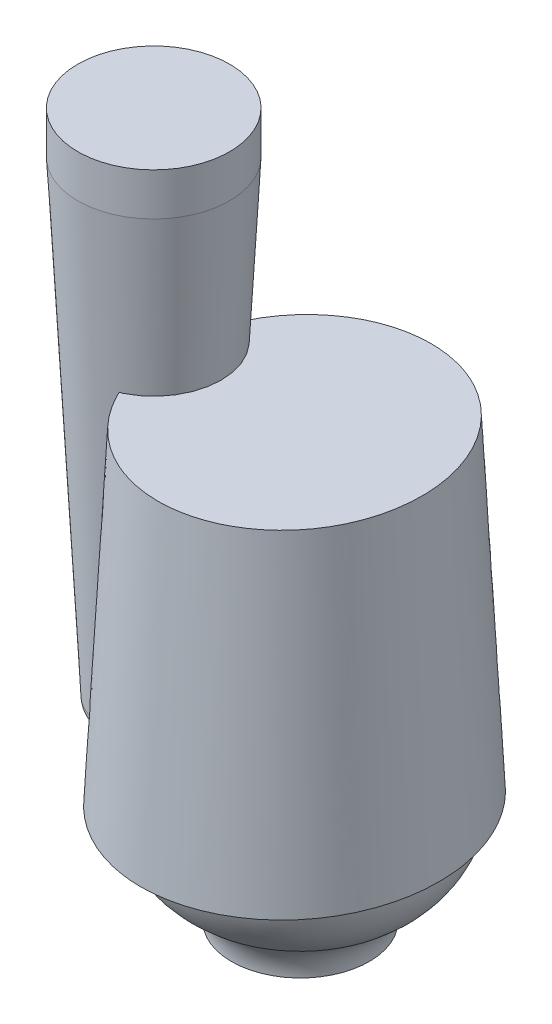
ISO-10303-21;
HEADER;
FILE_DESCRIPTION(('STEP AP214'),'2;1');
FILE_NAME('part.step','',(''),(''),'','','');
FILE_SCHEMA(('AUTOMOTIVE_DESIGN { 1 0 10303 214 1 1 1 1 }'));
ENDSEC;
DATA;
#1=APPLICATION_CONTEXT('core data for automotive mechanical design processes');
#2=APPLICATION_PROTOCOL_DEFINITION('international standard','automotive_design',2000,#1);
#3=PRODUCT_CONTEXT('',#1,'mechanical');
#4=PRODUCT('Part','Part','',(#3));
#5=PRODUCT_RELATED_PRODUCT_CATEGORY('part','',(#4));
#6=PRODUCT_DEFINITION_FORMATION('','',#4);
#7=PRODUCT_DEFINITION_CONTEXT('part definition',#1,'design');
#8=PRODUCT_DEFINITION('design','',#6,#7);
#9=PRODUCT_DEFINITION_SHAPE('','',#8);
#10=(LENGTH_UNIT() NAMED_UNIT(*) SI_UNIT(.MILLI.,.METRE.));
#11=(NAMED_UNIT(*) PLANE_ANGLE_UNIT() SI_UNIT($,.RADIAN.));
#12=(NAMED_UNIT(*) SI_UNIT($,.STERADIAN.) SOLID_ANGLE_UNIT());
#13=UNCERTAINTY_MEASURE_WITH_UNIT(LENGTH_MEASURE(1.E-05),#10,'distance_accuracy_value','');
#14=(GEOMETRIC_REPRESENTATION_CONTEXT(3) GLOBAL_UNCERTAINTY_ASSIGNED_CONTEXT((#13)) GLOBAL_UNIT_ASSIGNED_CONTEXT((#10,
#11,#12)) REPRESENTATION_CONTEXT('',''));
#15=CARTESIAN_POINT('',(0.,0.,0.));
#16=DIRECTION('',(0.,0.,1.));
#17=DIRECTION('',(1.,0.,0.));
#18=AXIS2_PLACEMENT_3D('',#15,#16,#17);
#19=CARTESIAN_POINT('',(-9.73244357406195,37.6685351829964,0.));
#20=DIRECTION('',(0.,1.,0.));
#21=DIRECTION('',(-1.,0.,0.));
#22=AXIS2_PLACEMENT_3D('',#19,#20,#21);
#23=CYLINDRICAL_SURFACE('',#22,5.03681306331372);
#24=CARTESIAN_POINT('',(-9.73244357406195,34.9999999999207,0.));
#25=DIRECTION('',(0.,1.,0.));
#26=DIRECTION('',(-1.,0.,0.));
#27=AXIS2_PLACEMENT_3D('',#24,#25,#26);
#28=CIRCLE('',#27,5.03681306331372);
#29=CARTESIAN_POINT('',(-14.7692566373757,34.9999999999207,0.));
#30=VERTEX_POINT('',#29);
#31=EDGE_CURVE('E11',#30,#30,#28,.T.);
#32=ORIENTED_EDGE('',*,*,#31,.F.);
#33=EDGE_LOOP('',(#32));
#34=FACE_BOUND('',#33,.T.);
#35=CARTESIAN_POINT('',(-9.73244357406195,32.1779999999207,0.));
#36=DIRECTION('',(0.,1.,0.));
#37=DIRECTION('',(-1.,0.,0.));
#38=AXIS2_PLACEMENT_3D('',#35,#36,#37);
#39=CIRCLE('',#38,5.03681306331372);
#40=CARTESIAN_POINT('',(-14.7692566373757,32.1779999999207,0.));
#41=VERTEX_POINT('',#40);
#42=EDGE_CURVE('E53',#41,#41,#39,.T.);
#43=ORIENTED_EDGE('',*,*,#42,.T.);
#44=EDGE_LOOP('',(#43));
#45=FACE_BOUND('',#44,.T.);
#46=ADVANCED_FACE('F39',(#34,#45),#23,.T.);
#47=CARTESIAN_POINT('',(-4.69563051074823,34.9999999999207,0.));
#48=DIRECTION('',(0.,-1.,0.));
#49=DIRECTION('',(1.,0.,0.));
#50=AXIS2_PLACEMENT_3D('',#47,#48,#49);
#51=PLANE('',#50);
#52=ORIENTED_EDGE('',*,*,#31,.T.);
#53=EDGE_LOOP('',(#52));
#54=FACE_BOUND('',#53,.T.);
#55=ADVANCED_FACE('F73',(#54),#51,.F.);
#56=CARTESIAN_POINT('',(-9.73244357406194,0.,0.));
#57=DIRECTION('',(0.,1.,0.));
#58=DIRECTION('',(-1.,0.,0.));
#59=AXIS2_PLACEMENT_3D('',#56,#57,#58);
#60=PLANE('',#59);
#61=CARTESIAN_POINT('',(-9.73244357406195,0.,0.));
#62=DIRECTION('',(0.,1.,0.));
#63=DIRECTION('',(-1.,0.,0.));
#64=AXIS2_PLACEMENT_3D('',#61,#62,#63);
#65=CIRCLE('',#64,2.11678160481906);
#66=CARTESIAN_POINT('',(-11.849225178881,0.,0.));
#67=VERTEX_POINT('',#66);
#68=EDGE_CURVE('E45',#67,#67,#65,.T.);
#69=ORIENTED_EDGE('',*,*,#68,.F.);
#70=EDGE_LOOP('',(#69));
#71=FACE_BOUND('',#70,.T.);
#72=ADVANCED_FACE('F68',(#71),#60,.F.);
#73=CARTESIAN_POINT('',(-9.73244357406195,1.3,0.));
#74=DIRECTION('',(0.,1.,0.));
#75=DIRECTION('',(-1.,0.,0.));
#76=AXIS2_PLACEMENT_3D('',#73,#74,#75);
#77=TOROIDAL_SURFACE('',#76,2.11678160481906,1.3);
#78=CARTESIAN_POINT('',(-9.73244357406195,1.23196325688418,0.));
#79=DIRECTION('',(0.,1.,0.));
#80=DIRECTION('',(-1.,0.,0.));
#81=AXIS2_PLACEMENT_3D('',#78,#79,#80);
#82=CIRCLE('',#81,3.415);
#83=CARTESIAN_POINT('',(-13.147443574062,1.23196325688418,0.));
#84=VERTEX_POINT('',#83);
#85=EDGE_CURVE('E49',#84,#84,#82,.T.);
#86=ORIENTED_EDGE('',*,*,#85,.F.);
#87=EDGE_LOOP('',(#86));
#88=FACE_BOUND('',#87,.T.);
#89=ORIENTED_EDGE('',*,*,#68,.T.);
#90=EDGE_LOOP('',(#89));
#91=FACE_BOUND('',#90,.T.);
#92=ADVANCED_FACE('F63',(#88,#91),#77,.T.);
#93=CARTESIAN_POINT('',(-9.73244357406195,1.23196325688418,0.));
#94=DIRECTION('',(0.,1.,0.));
#95=DIRECTION('',(-1.,0.,0.));
#96=AXIS2_PLACEMENT_3D('',#93,#94,#95);
#97=CONICAL_SURFACE('',#96,3.415,0.0523598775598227);
#98=ORIENTED_EDGE('',*,*,#42,.F.);
#99=EDGE_LOOP('',(#98));
#100=FACE_BOUND('',#99,.T.);
#101=ORIENTED_EDGE('',*,*,#85,.T.);
#102=EDGE_LOOP('',(#101));
#103=FACE_BOUND('',#102,.T.);
#104=ADVANCED_FACE('F60',(#100,#103),#97,.T.);
#105=CLOSED_SHELL('',(#46,#55,#72,#92,#104));
#106=MANIFOLD_SOLID_BREP('B2',#105);
#107=CARTESIAN_POINT('',(-4.575,-6.9,0.));
#108=DIRECTION('',(0.,1.,0.));
#109=DIRECTION('',(0.,0.,1.));
#110=AXIS2_PLACEMENT_3D('',#107,#108,#109);
#111=PLANE('',#110);
#112=CARTESIAN_POINT('',(0.,-6.9,0.));
#113=DIRECTION('',(0.,1.,0.));
#114=DIRECTION('',(0.,0.,1.));
#115=AXIS2_PLACEMENT_3D('',#112,#113,#114);
#116=CIRCLE('',#115,4.575);
#117=CARTESIAN_POINT('',(0.,-6.9,4.575));
#118=VERTEX_POINT('',#117);
#119=EDGE_CURVE('E38',#118,#118,#116,.T.);
#120=ORIENTED_EDGE('',*,*,#119,.F.);
#121=EDGE_LOOP('',(#120));
#122=FACE_BOUND('',#121,.T.);
#123=ADVANCED_FACE('F110',(#122),#111,.F.);
#124=CARTESIAN_POINT('',(0.,-6.9,0.));
#125=DIRECTION('',(0.,1.,0.));
#126=DIRECTION('',(0.,0.,1.));
#127=AXIS2_PLACEMENT_3D('',#124,#125,#126);
#128=TOROIDAL_SURFACE('',#127,7.575,3.);
#129=CARTESIAN_POINT('',(0.,-4.3359788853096,0.));
#130=DIRECTION('',(0.,1.,0.));
#131=DIRECTION('',(0.,0.,1.));
#132=AXIS2_PLACEMENT_3D('',#129,#130,#131);
#133=CIRCLE('',#132,6.01750337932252);
#134=CARTESIAN_POINT('',(0.,-4.3359788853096,6.01750337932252));
#135=VERTEX_POINT('',#134);
#136=EDGE_CURVE('E119',#135,#135,#133,.T.);
#137=ORIENTED_EDGE('',*,*,#136,.F.);
#138=EDGE_LOOP('',(#137));
#139=FACE_BOUND('',#138,.T.);
#140=ORIENTED_EDGE('',*,*,#119,.T.);
#141=EDGE_LOOP('',(#140));
#142=FACE_BOUND('',#141,.T.);
#143=ADVANCED_FACE('F158',(#139,#142),#128,.F.);
#144=CARTESIAN_POINT('',(0.,0.792063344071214,0.));
#145=DIRECTION('',(0.,1.,0.));
#146=DIRECTION('',(0.,0.,1.));
#147=AXIS2_PLACEMENT_3D('',#144,#145,#146);
#148=DEGENERATE_TOROIDAL_SURFACE('',#147,2.90251013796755,6.,.T.);
#149=CARTESIAN_POINT('',(0.,0.,0.));
#150=DIRECTION('',(0.,1.,0.));
#151=DIRECTION('',(0.,0.,1.));
#152=AXIS2_PLACEMENT_3D('',#149,#150,#151);
#153=CIRCLE('',#152,8.85);
#154=CARTESIAN_POINT('',(0.,0.,8.85));
#155=VERTEX_POINT('',#154);
#156=EDGE_CURVE('E124',#155,#155,#153,.T.);
#157=ORIENTED_EDGE('',*,*,#156,.F.);
#158=EDGE_LOOP('',(#157));
#159=FACE_BOUND('',#158,.T.);
#160=ORIENTED_EDGE('',*,*,#136,.T.);
#161=EDGE_LOOP('',(#160));
#162=FACE_BOUND('',#161,.T.);
#163=ADVANCED_FACE('F152',(#159,#162),#148,.T.);
#164=CARTESIAN_POINT('',(-0.379855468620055,0.,-9.05999349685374));
#165=DIRECTION('',(0.,-1.,0.));
#166=DIRECTION('',(0.,0.,-1.));
#167=AXIS2_PLACEMENT_3D('',#164,#165,#166);
#168=PLANE('',#167);
#169=CARTESIAN_POINT('',(-0.378402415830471,0.,-10.192000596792));
#170=CARTESIAN_POINT('',(-0.507007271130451,0.,-10.1921862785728));
#171=CARTESIAN_POINT('',(-0.635622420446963,0.,-10.1896287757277));
#172=CARTESIAN_POINT('',(-0.892632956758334,0.,-10.1790601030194));
#173=CARTESIAN_POINT('',(-1.02102832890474,0.,-10.1710485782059));
#174=CARTESIAN_POINT('',(-1.27739759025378,0.,-10.1495308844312));
#175=CARTESIAN_POINT('',(-1.40537135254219,0.,-10.1360231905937));
#176=CARTESIAN_POINT('',(-1.66061259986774,0.,-10.1035497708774));
#177=CARTESIAN_POINT('',(-1.7878800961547,0.,-10.0845841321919));
#178=CARTESIAN_POINT('',(-2.16858171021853,0.,-10.0195774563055));
#179=CARTESIAN_POINT('',(-2.42068390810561,0.,-9.96544622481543));
#180=CARTESIAN_POINT('',(-2.91937723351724,0.,-9.83615786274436));
#181=CARTESIAN_POINT('',(-3.16596878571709,0.,-9.76100235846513));
#182=CARTESIAN_POINT('',(-3.65160816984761,0.,-9.59041030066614));
#183=CARTESIAN_POINT('',(-3.89066714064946,0.,-9.49500547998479));
#184=CARTESIAN_POINT('',(-4.36004480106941,0.,-9.28469929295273));
#185=CARTESIAN_POINT('',(-4.59036337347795,0.,-9.169797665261));
#186=CARTESIAN_POINT('',(-5.04071983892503,0.,-8.921487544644));
#187=CARTESIAN_POINT('',(-5.26076014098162,0.,-8.78808341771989));
#188=CARTESIAN_POINT('',(-5.68933559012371,0.,-8.50393281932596));
#189=CARTESIAN_POINT('',(-5.89787051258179,0.,-8.35318600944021));
#190=CARTESIAN_POINT('',(-6.30754408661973,0.,-8.03132078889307));
#191=CARTESIAN_POINT('',(-6.50834368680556,0.,-7.85977068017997));
#192=CARTESIAN_POINT('',(-6.89528996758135,0.,-7.50088751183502));
#193=CARTESIAN_POINT('',(-7.08143659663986,0.,-7.31355439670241));
#194=CARTESIAN_POINT('',(-7.43825131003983,0.,-6.92462790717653));
#195=CARTESIAN_POINT('',(-7.60891628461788,0.,-6.72303168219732));
#196=CARTESIAN_POINT('',(-7.93382976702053,0.,-6.30701525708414));
#197=CARTESIAN_POINT('',(-8.08807754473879,0.,-6.09259448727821));
#198=CARTESIAN_POINT('',(-8.38703932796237,0.,-5.64110479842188));
#199=CARTESIAN_POINT('',(-8.53085068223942,0.,-5.40343814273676));
#200=CARTESIAN_POINT('',(-8.79898835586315,0.,-4.91736095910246));
#201=CARTESIAN_POINT('',(-8.923314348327,0.,-4.66895025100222));
#202=CARTESIAN_POINT('',(-9.15181197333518,0.,-4.16296877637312));
#203=CARTESIAN_POINT('',(-9.25597945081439,0.,-3.90539613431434));
#204=CARTESIAN_POINT('',(-9.44375483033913,0.,-3.38286329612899));
#205=CARTESIAN_POINT('',(-9.52736214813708,0.,-3.11790289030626));
#206=CARTESIAN_POINT('',(-9.67786051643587,0.,-2.56671926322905));
#207=CARTESIAN_POINT('',(-9.74350060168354,0.,-2.28015418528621));
#208=CARTESIAN_POINT('',(-9.85137152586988,0.,-1.70264482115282));
#209=CARTESIAN_POINT('',(-9.8936011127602,0.,-1.41170030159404));
#210=CARTESIAN_POINT('',(-9.95431388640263,0.,-0.827279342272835));
#211=CARTESIAN_POINT('',(-9.97279146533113,0.,-0.53380232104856));
#212=CARTESIAN_POINT('',(-9.98585546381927,0.,0.0537119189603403));
#213=CARTESIAN_POINT('',(-9.98044226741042,0.,0.34774912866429));
#214=CARTESIAN_POINT('',(-9.95408315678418,0.,0.792937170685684));
#215=CARTESIAN_POINT('',(-9.9418809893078,0.,0.944651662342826));
#216=CARTESIAN_POINT('',(-9.91106989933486,0.,1.24742894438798));
#217=CARTESIAN_POINT('',(-9.8924608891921,0.,1.39849172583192));
#218=CARTESIAN_POINT('',(-9.82716426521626,0.,1.85032151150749));
#219=CARTESIAN_POINT('',(-9.77100415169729,0.,2.14977843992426));
#220=CARTESIAN_POINT('',(-9.63352585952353,0.,2.74284163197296));
#221=CARTESIAN_POINT('',(-9.5522058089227,0.,3.03644745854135));
#222=CARTESIAN_POINT('',(-9.36465533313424,0.,3.61564014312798));
#223=CARTESIAN_POINT('',(-9.25842654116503,0.,3.90122752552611));
#224=CARTESIAN_POINT('',(-9.08123378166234,0.,4.32080114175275));
#225=CARTESIAN_POINT('',(-9.01944007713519,0.,4.45872661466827));
#226=CARTESIAN_POINT('',(-8.88988183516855,0.,4.73175728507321));
#227=CARTESIAN_POINT('',(-8.82211729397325,0.,4.86686248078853));
#228=CARTESIAN_POINT('',(-8.68074838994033,0.,5.13398967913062));
#229=CARTESIAN_POINT('',(-8.60714364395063,0.,5.26601147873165));
#230=CARTESIAN_POINT('',(-8.45423371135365,0.,5.526711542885));
#231=CARTESIAN_POINT('',(-8.37492861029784,0.,5.65538985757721));
#232=CARTESIAN_POINT('',(-8.21067635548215,0.,5.90906178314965));
#233=CARTESIAN_POINT('',(-8.12573020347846,0.,6.03405604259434));
#234=CARTESIAN_POINT('',(-7.95040477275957,0.,6.28017398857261));
#235=CARTESIAN_POINT('',(-7.86002547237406,0.,6.40129765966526));
#236=CARTESIAN_POINT('',(-7.67394975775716,0.,6.63938059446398));
#237=CARTESIAN_POINT('',(-7.57825371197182,0.,6.7563401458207));
#238=CARTESIAN_POINT('',(-7.3815668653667,0.,6.98571699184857));
#239=CARTESIAN_POINT('',(-7.28057613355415,0.,7.09813434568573));
#240=CARTESIAN_POINT('',(-7.07844500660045,0.,7.31308230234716));
#241=CARTESIAN_POINT('',(-6.9775347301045,0.,7.41582925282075));
#242=CARTESIAN_POINT('',(-6.77126477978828,0.,7.61676005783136));
#243=CARTESIAN_POINT('',(-6.66590473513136,0.,7.71494353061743));
#244=CARTESIAN_POINT('',(-6.34341689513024,0.,8.00227489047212));
#245=CARTESIAN_POINT('',(-6.11982475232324,0.,8.18426405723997));
#246=CARTESIAN_POINT('',(-5.65733234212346,0.,8.52737210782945));
#247=CARTESIAN_POINT('',(-5.41843701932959,0.,8.68849768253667));
#248=CARTESIAN_POINT('',(-4.92689044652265,0.,8.98830735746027));
#249=CARTESIAN_POINT('',(-4.67424001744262,0.,9.12699279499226));
#250=CARTESIAN_POINT('',(-4.29452895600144,0.,9.31309242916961));
#251=CARTESIAN_POINT('',(-4.17198484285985,0.,9.36988066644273));
#252=CARTESIAN_POINT('',(-3.92455615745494,0.,9.47808606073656));
#253=CARTESIAN_POINT('',(-3.79967174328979,0.,9.52950357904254));
#254=CARTESIAN_POINT('',(-3.4218152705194,0.,9.67542841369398));
#255=CARTESIAN_POINT('',(-3.1655790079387,0.,9.76163795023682));
#256=CARTESIAN_POINT('',(-2.64664790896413,0.,9.91102022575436));
#257=CARTESIAN_POINT('',(-2.38395623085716,0.,9.9742039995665));
#258=CARTESIAN_POINT('',(-1.85386887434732,0.,10.0770559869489));
#259=CARTESIAN_POINT('',(-1.5864711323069,0.,10.1167136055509));
#260=CARTESIAN_POINT('',(-1.06104941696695,0.,10.1707898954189));
#261=CARTESIAN_POINT('',(-0.803131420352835,0.,10.1862434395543));
#262=CARTESIAN_POINT('',(-0.286921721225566,0.,10.1951170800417));
#263=CARTESIAN_POINT('',(-0.028630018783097,0.,10.1885371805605));
#264=CARTESIAN_POINT('',(0.486450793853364,0.,10.1533138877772));
#265=CARTESIAN_POINT('',(0.743240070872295,0.,10.124672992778));
#266=CARTESIAN_POINT('',(1.12581467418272,0.,10.0653533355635));
#267=CARTESIAN_POINT('',(1.25291790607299,0.,10.0428504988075));
#268=CARTESIAN_POINT('',(1.50606665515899,0.,9.99249739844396));
#269=CARTESIAN_POINT('',(1.63211212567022,0.,9.96464690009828));
#270=CARTESIAN_POINT('',(2.0052628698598,0.,9.87384746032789));
#271=CARTESIAN_POINT('',(2.25053098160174,0.,9.80316038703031));
#272=CARTESIAN_POINT('',(2.73430595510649,0.,9.6416649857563));
#273=CARTESIAN_POINT('',(2.97281289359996,0.,9.55085688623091));
#274=CARTESIAN_POINT('',(3.44156730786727,0.,9.34994519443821));
#275=CARTESIAN_POINT('',(3.67181459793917,0.,9.23984116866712));
#276=CARTESIAN_POINT('',(4.12253981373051,0.,9.00119241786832));
#277=CARTESIAN_POINT('',(4.3430176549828,0.,8.87264753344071));
#278=CARTESIAN_POINT('',(4.77744822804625,0.,8.59521769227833));
#279=CARTESIAN_POINT('',(4.99116070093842,0.,8.44595665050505));
#280=CARTESIAN_POINT('',(5.40578090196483,0.,8.13060568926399));
#281=CARTESIAN_POINT('',(5.60668829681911,0.,7.96451533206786));
#282=CARTESIAN_POINT('',(5.99457251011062,0.,7.61674502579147));
#283=CARTESIAN_POINT('',(6.18154717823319,0.,7.43506267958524));
#284=CARTESIAN_POINT('',(6.54053453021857,0.,7.05748384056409));
#285=CARTESIAN_POINT('',(6.71254714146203,0.,6.86158727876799));
#286=CARTESIAN_POINT('',(7.048653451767,0.,6.44712970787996));
#287=CARTESIAN_POINT('',(7.21196060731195,0.,6.22793059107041));
#288=CARTESIAN_POINT('',(7.52048041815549,0.,5.77716007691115));
#289=CARTESIAN_POINT('',(7.66569196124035,0.,5.54558792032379));
#290=CARTESIAN_POINT('',(7.93745857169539,0.,5.07164399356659));
#291=CARTESIAN_POINT('',(8.06400969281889,0.,4.82926995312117));
#292=CARTESIAN_POINT('',(8.23916343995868,0.,4.45884607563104));
#293=CARTESIAN_POINT('',(8.29510671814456,0.,4.33421662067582));
#294=CARTESIAN_POINT('',(8.40208986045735,0.,4.08286204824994));
#295=CARTESIAN_POINT('',(8.45312968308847,0.,3.9561369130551));
#296=CARTESIAN_POINT('',(8.55311931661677,0.,3.69323268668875));
#297=CARTESIAN_POINT('',(8.60176608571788,0.,3.5569383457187));
#298=CARTESIAN_POINT('',(8.69340458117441,0.,3.28246033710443));
#299=CARTESIAN_POINT('',(8.73639622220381,0.,3.14427664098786));
#300=CARTESIAN_POINT('',(8.81678315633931,0.,2.86628136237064));
#301=CARTESIAN_POINT('',(8.85417802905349,0.,2.72646965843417));
#302=CARTESIAN_POINT('',(8.92333767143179,0.,2.44546065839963));
#303=CARTESIAN_POINT('',(8.95510247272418,0.,2.30426337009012));
#304=CARTESIAN_POINT('',(9.01289841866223,0.,2.02066634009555));
#305=CARTESIAN_POINT('',(9.03892823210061,0.,1.87826632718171));
#306=CARTESIAN_POINT('',(9.08530303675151,0.,1.59254486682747));
#307=CARTESIAN_POINT('',(9.10564802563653,0.,1.44922341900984));
#308=CARTESIAN_POINT('',(9.14056663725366,0.,1.16188045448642));
#309=CARTESIAN_POINT('',(9.15514045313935,0.,1.01785896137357));
#310=CARTESIAN_POINT('',(9.17847727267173,0.,0.729355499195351));
#311=CARTESIAN_POINT('',(9.18724025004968,0.,0.584873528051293));
#312=CARTESIAN_POINT('',(9.20533963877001,0.,0.138415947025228));
#313=CARTESIAN_POINT('',(9.20494252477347,0.,-0.164016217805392));
#314=CARTESIAN_POINT('',(9.17892359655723,0.,-0.767765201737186));
#315=CARTESIAN_POINT('',(9.15329968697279,0.,-1.06908192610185));
#316=CARTESIAN_POINT('',(9.07698497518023,0.,-1.6686083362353));
#317=CARTESIAN_POINT('',(9.02629140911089,0.,-1.96681767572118));
#318=CARTESIAN_POINT('',(8.93173838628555,0.,-2.41009843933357));
#319=CARTESIAN_POINT('',(8.89713138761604,0.,-2.55719931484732));
#320=CARTESIAN_POINT('',(8.82169855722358,0.,-2.84979775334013));
#321=CARTESIAN_POINT('',(8.780872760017,0.,-2.99529532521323));
#322=CARTESIAN_POINT('',(8.64850185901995,0.,-3.43105052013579));
#323=CARTESIAN_POINT('',(8.54750340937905,0.,-3.71849898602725));
#324=CARTESIAN_POINT('',(8.32100322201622,0.,-4.28355680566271));
#325=CARTESIAN_POINT('',(8.1955001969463,0.,-4.56116564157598));
#326=CARTESIAN_POINT('',(7.92067930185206,0.,-5.10429723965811));
#327=CARTESIAN_POINT('',(7.77136509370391,0.,-5.36982185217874));
#328=CARTESIAN_POINT('',(7.44988044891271,0.,-5.8866502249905));
#329=CARTESIAN_POINT('',(7.27771161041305,0.,-6.13795497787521));
#330=CARTESIAN_POINT('',(6.91800045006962,0.,-6.6148743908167));
#331=CARTESIAN_POINT('',(6.73126255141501,0.,-6.84109552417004));
#332=CARTESIAN_POINT('',(6.33851319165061,0.,-7.27613183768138));
#333=CARTESIAN_POINT('',(6.13250269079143,0.,-7.48494788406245));
#334=CARTESIAN_POINT('',(5.7025459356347,0.,-7.88324026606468));
#335=CARTESIAN_POINT('',(5.47859947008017,0.,-8.07271637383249));
#336=CARTESIAN_POINT('',(5.01432512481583,0.,-8.43040234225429));
#337=CARTESIAN_POINT('',(4.77399863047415,0.,-8.59861399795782));
#338=CARTESIAN_POINT('',(4.29383701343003,0.,-8.90250884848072));
#339=CARTESIAN_POINT('',(4.05485754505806,0.,-9.03954674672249));
#340=CARTESIAN_POINT('',(3.5657108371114,0.,-9.29210308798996));
#341=CARTESIAN_POINT('',(3.31554301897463,0.,-9.40762041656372));
#342=CARTESIAN_POINT('',(2.93359809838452,0.,-9.56377254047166));
#343=CARTESIAN_POINT('',(2.80524970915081,0.,-9.61294393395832));
#344=CARTESIAN_POINT('',(2.54646304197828,0.,-9.70546515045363));
#345=CARTESIAN_POINT('',(2.41602479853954,0.,-9.74881506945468));
#346=CARTESIAN_POINT('',(2.15337134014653,0.,-9.8295561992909));
#347=CARTESIAN_POINT('',(2.02115683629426,0.,-9.86694972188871));
#348=CARTESIAN_POINT('',(1.75519625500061,0.,-9.93578472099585));
#349=CARTESIAN_POINT('',(1.62145009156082,0.,-9.96722586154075));
#350=CARTESIAN_POINT('',(1.18066071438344,0.,-10.0602664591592));
#351=CARTESIAN_POINT('',(0.87075817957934,0.,-10.1090056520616));
#352=CARTESIAN_POINT('',(0.4036150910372,0.,-10.1582326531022));
#353=CARTESIAN_POINT('',(0.247503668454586,0.,-10.1706614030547));
#354=CARTESIAN_POINT('',(0.0129870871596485,0.,-10.1832515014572));
#355=CARTESIAN_POINT('',(-0.0652535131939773,0.,-10.1864393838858));
#356=CARTESIAN_POINT('',(-0.221795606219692,0.,-10.1907574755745));
#357=CARTESIAN_POINT('',(-0.300097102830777,0.,-10.191887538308));
#358=CARTESIAN_POINT('',(-0.378402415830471,0.,-10.192000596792));
#359=B_SPLINE_CURVE_WITH_KNOTS('',3,(#169,#170,#171,#172,#173,#174,#175,#176,#177,#178,#179,
#180,#181,#182,#183,#184,#185,#186,#187,#188,#189,#190,#191,#192,#193,#194,#195,#196,#197,#198,
#199,#200,#201,#202,#203,#204,#205,#206,#207,#208,#209,#210,#211,#212,#213,#214,#215,#216,#217,
#218,#219,#220,#221,#222,#223,#224,#225,#226,#227,#228,#229,#230,#231,#232,#233,#234,#235,#236,
#237,#238,#239,#240,#241,#242,#243,#244,#245,#246,#247,#248,#249,#250,#251,#252,#253,#254,#255,
#256,#257,#258,#259,#260,#261,#262,#263,#264,#265,#266,#267,#268,#269,#270,#271,#272,#273,#274,
#275,#276,#277,#278,#279,#280,#281,#282,#283,#284,#285,#286,#287,#288,#289,#290,#291,#292,#293,
#294,#295,#296,#297,#298,#299,#300,#301,#302,#303,#304,#305,#306,#307,#308,#309,#310,#311,#312,
#313,#314,#315,#316,#317,#318,#319,#320,#321,#322,#323,#324,#325,#326,#327,#328,#329,#330,#331,
#332,#333,#334,#335,#336,#337,#338,#339,#340,#341,#342,#343,#344,#345,#346,#347,#348,#349,#350,
#351,#352,#353,#354,#355,#356,#357,#358),.UNSPECIFIED.,.T.,.F.,(4,2,2,2,2,2,2,2,2,2,2,2,2,2,2,2,
2,2,2,2,2,2,2,2,2,2,2,2,2,2,2,2,2,2,2,2,2,2,2,2,2,2,2,2,2,2,2,2,2,2,2,2,2,2,2,2,2,2,2,2,2,2,2,2,
2,2,2,2,2,2,2,2,2,2,2,2,2,2,2,2,2,2,2,2,2,2,2,2,2,2,2,2,2,2,4),(0.,0.385797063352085,
0.771619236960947,1.15754852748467,1.54347165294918,2.31601127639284,3.08849115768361,
3.85976930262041,4.63105778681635,5.40216458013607,6.1732864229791,6.96470085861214,
7.75611807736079,8.54769391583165,9.33930494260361,10.1717635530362,11.0042361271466,
11.8368801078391,12.6695477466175,13.5505153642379,14.4315300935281,15.3127527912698,
16.1939613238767,16.6504544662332,17.106953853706,18.0198073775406,18.9327288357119,
19.8455904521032,20.2988796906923,20.7521692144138,21.2054885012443,21.6588009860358,
22.1120331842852,22.5652671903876,23.0184698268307,23.4716665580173,23.9035632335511,
24.3354959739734,25.1991140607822,26.0624544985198,26.9257434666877,27.3308248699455,
27.7358790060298,28.5457842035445,29.3553007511,30.1651815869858,30.9393853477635,
31.7135889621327,32.487704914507,32.8748444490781,33.2620009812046,34.0267855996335,
34.7915615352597,35.5563546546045,36.3211543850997,37.1023041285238,37.8834741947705,
38.6647645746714,39.4460587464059,40.26517767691,41.084346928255,41.9036891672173,
42.3134308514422,42.7231760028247,43.1572000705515,43.5912306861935,44.0252938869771,
44.4593546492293,44.8935160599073,45.3276776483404,45.7618247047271,46.1959737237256,
47.1021081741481,48.0083178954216,48.9146275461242,49.3678625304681,49.8210949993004,
50.7338926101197,51.6467381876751,52.5594435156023,53.4720850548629,54.3509619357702,
55.2297950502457,56.1086385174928,56.9874077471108,57.8128356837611,58.6383063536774,
59.0505279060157,59.4627426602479,59.8747970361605,60.286874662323,61.2259999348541,
61.6956552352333,61.9305437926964,62.1654490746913),.UNSPECIFIED.);
#360=CARTESIAN_POINT('',(-0.378402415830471,0.,-10.192000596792));
#361=VERTEX_POINT('',#360);
#362=EDGE_CURVE('E134',#361,#361,#359,.T.);
#363=ORIENTED_EDGE('',*,*,#362,.F.);
#364=EDGE_LOOP('',(#363));
#365=FACE_BOUND('',#364,.T.);
#366=ORIENTED_EDGE('',*,*,#156,.T.);
#367=EDGE_LOOP('',(#366));
#368=FACE_BOUND('',#367,.T.);
#369=ADVANCED_FACE('F149',(#365,#368),#168,.T.);
#370=CARTESIAN_POINT('',(-0.389999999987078,-4.332,10.4190385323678));
#371=CARTESIAN_POINT('',(-1.06849843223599,-4.332,10.4190385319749));
#372=CARTESIAN_POINT('',(-1.74386346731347,-4.332,10.3445697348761));
#373=CARTESIAN_POINT('',(-3.06411378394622,-4.332,10.0519207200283));
#374=CARTESIAN_POINT('',(-3.69743511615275,-4.33200000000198,9.83692027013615));
#375=CARTESIAN_POINT('',(-4.60423683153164,-4.33199999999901,9.42005413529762));
#376=CARTESIAN_POINT('',(-4.90003600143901,-4.332,9.26490801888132));
#377=CARTESIAN_POINT('',(-5.47770093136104,-4.332,8.92227471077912));
#378=CARTESIAN_POINT('',(-5.75821578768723,-4.331999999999,8.73534713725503));
#379=CARTESIAN_POINT('',(-6.55961981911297,-4.33200000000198,8.14041102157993));
#380=CARTESIAN_POINT('',(-7.04585249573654,-4.332,7.69621458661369));
#381=CARTESIAN_POINT('',(-7.9314870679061,-4.332,6.71360811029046));
#382=CARTESIAN_POINT('',(-8.32943279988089,-4.332,6.17306783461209));
#383=CARTESIAN_POINT('',(-9.00598000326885,-4.332,5.04748849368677));
#384=CARTESIAN_POINT('',(-9.28869420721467,-4.33200000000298,4.45964719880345));
#385=CARTESIAN_POINT('',(-9.63293196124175,-4.3319999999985,3.53720409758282));
#386=CARTESIAN_POINT('',(-9.73440427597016,-4.3319999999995,3.2218454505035));
#387=CARTESIAN_POINT('',(-9.90750619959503,-4.3320000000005,2.58651638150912));
#388=CARTESIAN_POINT('',(-9.97909592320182,-4.33199999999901,2.26734939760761));
#389=CARTESIAN_POINT('',(-10.1508383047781,-4.33200000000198,1.30622261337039));
#390=CARTESIAN_POINT('',(-10.2089174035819,-4.33200000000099,0.657965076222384));
#391=CARTESIAN_POINT('',(-10.2090988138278,-4.3319999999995,-0.325924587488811));
#392=CARTESIAN_POINT('',(-10.1943628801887,-4.3320000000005,-0.656410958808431));
#393=CARTESIAN_POINT('',(-10.1360653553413,-4.3319999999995,-1.30961248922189));
#394=CARTESIAN_POINT('',(-10.0926183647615,-4.3319999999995,-1.63314479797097));
#395=CARTESIAN_POINT('',(-9.9202663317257,-4.33200000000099,-2.59433625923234));
#396=CARTESIAN_POINT('',(-9.74907221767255,-4.33199999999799,-3.2261595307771));
#397=CARTESIAN_POINT('',(-9.28661871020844,-4.332000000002,-4.46503575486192));
#398=CARTESIAN_POINT('',(-9.00010883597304,-4.332,-5.05872342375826));
#399=CARTESIAN_POINT('',(-8.49202105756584,-4.332,-5.90181365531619));
#400=CARTESIAN_POINT('',(-8.30911292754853,-4.3320000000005,-6.17573472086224));
#401=CARTESIAN_POINT('',(-7.91453232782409,-4.3319999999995,-6.70894423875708));
#402=CARTESIAN_POINT('',(-7.70242048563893,-4.332,-6.96839667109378));
#403=CARTESIAN_POINT('',(-7.03432939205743,-4.332,-7.70767891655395));
#404=CARTESIAN_POINT('',(-6.54506618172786,-4.332,-8.15296604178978));
#405=CARTESIAN_POINT('',(-5.74021201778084,-4.332,-8.74779520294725));
#406=CARTESIAN_POINT('',(-5.45885083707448,-4.332,-8.93431493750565));
#407=CARTESIAN_POINT('',(-4.88097138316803,-4.332,-9.27529796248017));
#408=CARTESIAN_POINT('',(-4.58496637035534,-4.3320000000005,-9.42974515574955));
#409=CARTESIAN_POINT('',(-3.97837918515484,-4.33199999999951,-9.70687752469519));
#410=CARTESIAN_POINT('',(-3.66788986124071,-4.332,-9.82953187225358));
#411=CARTESIAN_POINT('',(-3.03167887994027,-4.332,-10.0423296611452));
#412=CARTESIAN_POINT('',(-2.70458311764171,-4.332000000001,-10.1326778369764));
#413=CARTESIAN_POINT('',(-1.71480385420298,-4.331999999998,-10.348736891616));
#414=CARTESIAN_POINT('',(-1.04995035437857,-4.331999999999,-10.4198931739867));
#415=CARTESIAN_POINT('',(0.293724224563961,-4.33200000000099,-10.4181686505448));
#416=CARTESIAN_POINT('',(0.973065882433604,-4.332,-10.3427301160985));
#417=CARTESIAN_POINT('',(2.28026251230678,-4.332,-10.0525733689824));
#418=CARTESIAN_POINT('',(2.91188517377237,-4.33199999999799,-9.83961165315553));
#419=CARTESIAN_POINT('',(3.8294605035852,-4.332000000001,-9.41758247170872));
#420=CARTESIAN_POINT('',(4.12823324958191,-4.332,-9.26032098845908));
#421=CARTESIAN_POINT('',(4.70144341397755,-4.332,-8.9197740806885));
#422=CARTESIAN_POINT('',(4.97722987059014,-4.332,-8.73594355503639));
#423=CARTESIAN_POINT('',(5.50830526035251,-4.332,-8.34196025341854));
#424=CARTESIAN_POINT('',(5.76357942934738,-4.332,-8.13179710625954));
#425=CARTESIAN_POINT('',(6.25390009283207,-4.332,-7.68534422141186));
#426=CARTESIAN_POINT('',(6.48975736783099,-4.332000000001,-7.44808791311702));
#427=CARTESIAN_POINT('',(7.15868427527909,-4.33199999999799,-6.70502574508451));
#428=CARTESIAN_POINT('',(7.54804014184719,-4.33200000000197,-6.17476518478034));
#429=CARTESIAN_POINT('',(8.05356528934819,-4.33199999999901,-5.33464301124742));
#430=CARTESIAN_POINT('',(8.20932091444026,-4.332,-5.04638179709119));
#431=CARTESIAN_POINT('',(8.49502092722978,-4.332,-4.45350494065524));
#432=CARTESIAN_POINT('',(8.62523749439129,-4.33199999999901,-4.14784972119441));
#433=CARTESIAN_POINT('',(8.97012710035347,-4.332000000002,-3.22214689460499));
#434=CARTESIAN_POINT('',(9.14050797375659,-4.332,-2.59311580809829));
#435=CARTESIAN_POINT('',(9.31259864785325,-4.332,-1.63319111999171));
#436=CARTESIAN_POINT('',(9.35604890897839,-4.332,-1.30978930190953));
#437=CARTESIAN_POINT('',(9.41437537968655,-4.332,-0.656278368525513));
#438=CARTESIAN_POINT('',(9.42907724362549,-4.33200000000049,-0.326111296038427));
#439=CARTESIAN_POINT('',(9.42896087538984,-4.331999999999,0.656159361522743));
#440=CARTESIAN_POINT('',(9.3712545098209,-4.332,1.30357621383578));
#441=CARTESIAN_POINT('',(9.14176685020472,-4.332,2.58849843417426));
#442=CARTESIAN_POINT('',(8.96770138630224,-4.33199999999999,3.22954144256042));
#443=CARTESIAN_POINT('',(8.50914366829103,-4.33199999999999,4.45856130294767));
#444=CARTESIAN_POINT('',(8.22590264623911,-4.332,5.04813061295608));
#445=CARTESIAN_POINT('',(7.71533143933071,-4.332,5.89680118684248));
#446=CARTESIAN_POINT('',(7.53015096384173,-4.332000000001,6.17420022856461));
#447=CARTESIAN_POINT('',(7.13638155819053,-4.33199999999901,6.70657611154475));
#448=CARTESIAN_POINT('',(6.92750351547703,-4.33200000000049,6.96227391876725));
#449=CARTESIAN_POINT('',(6.48549560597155,-4.3319999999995,7.45236291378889));
#450=CARTESIAN_POINT('',(6.2525517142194,-4.331999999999,7.68669048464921));
#451=CARTESIAN_POINT('',(5.76103031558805,-4.33200000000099,8.13399869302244));
#452=CARTESIAN_POINT('',(5.50142776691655,-4.331999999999,8.34759574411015));
#453=CARTESIAN_POINT('',(4.69459845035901,-4.33200000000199,8.94451841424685));
#454=CARTESIAN_POINT('',(4.12232440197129,-4.33200000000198,9.28360556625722));
#455=CARTESIAN_POINT('',(3.21141678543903,-4.331999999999,9.70147613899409));
#456=CARTESIAN_POINT('',(2.89753972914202,-4.332000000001,9.82599120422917));
#457=CARTESIAN_POINT('',(2.25755730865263,-4.33199999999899,10.0406689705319));
#458=CARTESIAN_POINT('',(1.93395764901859,-4.331999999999,10.1301335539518));
#459=CARTESIAN_POINT('',(0.955125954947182,-4.33200000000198,10.3452674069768));
#460=CARTESIAN_POINT('',(0.288498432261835,-4.332,10.4190385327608));
#461=CARTESIAN_POINT('',(-0.389999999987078,-4.332,10.4190385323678));
#462=CARTESIAN_POINT('',(-0.389999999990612,21.612,9.05937110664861));
#463=CARTESIAN_POINT('',(-0.969255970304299,21.612,9.05937110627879));
#464=CARTESIAN_POINT('',(-1.54513625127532,21.612,8.9959501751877));
#465=CARTESIAN_POINT('',(-2.67435158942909,21.612,8.74564626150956));
#466=CARTESIAN_POINT('',(-3.21532089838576,21.612,8.56209498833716));
#467=CARTESIAN_POINT('',(-3.99341864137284,21.612,8.20439544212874));
#468=CARTESIAN_POINT('',(-4.24717074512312,21.612,8.07129626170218));
#469=CARTESIAN_POINT('',(-4.74330507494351,21.612,7.77702164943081));
#470=CARTESIAN_POINT('',(-4.9848331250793,21.612,7.61610329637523));
#471=CARTESIAN_POINT('',(-5.67500969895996,21.612,7.10373870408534));
#472=CARTESIAN_POINT('',(-6.09569673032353,21.612,6.71954540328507));
#473=CARTESIAN_POINT('',(-6.86169735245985,21.612,5.8696723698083));
#474=CARTESIAN_POINT('',(-7.20794893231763,21.612,5.39961976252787));
#475=CARTESIAN_POINT('',(-7.7967485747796,21.612,4.42002677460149));
#476=CARTESIAN_POINT('',(-8.04388587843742,21.611999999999,3.90642867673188));
#477=CARTESIAN_POINT('',(-8.34455157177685,21.6120000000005,3.10074443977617));
#478=CARTESIAN_POINT('',(-8.4333499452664,21.6119999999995,2.82480813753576));
#479=CARTESIAN_POINT('',(-8.58486662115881,21.6120000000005,2.26870244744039));
#480=CARTESIAN_POINT('',(-8.64762443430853,21.612,1.98903170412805));
#481=CARTESIAN_POINT('',(-8.7983802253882,21.612,1.14535265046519));
#482=CARTESIAN_POINT('',(-8.84926489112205,21.611999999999,0.576729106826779));
#483=CARTESIAN_POINT('',(-8.84942396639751,21.6120000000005,-0.285684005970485));
#484=CARTESIAN_POINT('',(-8.83648872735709,21.6119999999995,-0.575764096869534));
#485=CARTESIAN_POINT('',(-8.78537073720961,21.6120000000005,-1.14852137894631));
#486=CARTESIAN_POINT('',(-8.74727659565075,21.6119999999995,-1.4323148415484));
#487=CARTESIAN_POINT('',(-8.59598249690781,21.612000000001,-2.27606800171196));
#488=CARTESIAN_POINT('',(-8.44620780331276,21.612000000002,-2.82849046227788));
#489=CARTESIAN_POINT('',(-8.04185660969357,21.611999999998,-3.9117152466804));
#490=CARTESIAN_POINT('',(-7.79204346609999,21.612,-4.42913335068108));
#491=CARTESIAN_POINT('',(-7.3492408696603,21.612,-5.16389330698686));
#492=CARTESIAN_POINT('',(-7.19008311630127,21.6119999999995,-5.40217819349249));
#493=CARTESIAN_POINT('',(-6.84765689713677,21.6120000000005,-5.8649098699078));
#494=CARTESIAN_POINT('',(-6.66369931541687,21.612,-6.08990433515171));
#495=CARTESIAN_POINT('',(-6.08545338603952,21.612,-6.72976745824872));
#496=CARTESIAN_POINT('',(-5.66241576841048,21.612,-7.11459569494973));
#497=CARTESIAN_POINT('',(-4.969357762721,21.612,-7.62680177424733));
#498=CARTESIAN_POINT('',(-4.72707186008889,21.612,-7.78738827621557));
#499=CARTESIAN_POINT('',(-4.23082203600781,21.612,-8.08020495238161));
#500=CARTESIAN_POINT('',(-3.976716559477,21.6119999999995,-8.21278712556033));
#501=CARTESIAN_POINT('',(-3.45659433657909,21.6120000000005,-8.45041611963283));
#502=CARTESIAN_POINT('',(-3.19058279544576,21.612,-8.55547227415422));
#503=CARTESIAN_POINT('',(-2.64640202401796,21.612,-8.73748813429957));
#504=CARTESIAN_POINT('',(-2.36657356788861,21.612,-8.81477709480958));
#505=CARTESIAN_POINT('',(-1.52090522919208,21.612,-8.99937806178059));
#506=CARTESIAN_POINT('',(-0.95260756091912,21.612000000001,-9.06009959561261));
#507=CARTESIAN_POINT('',(0.192895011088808,21.611999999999,-9.05862961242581));
#508=CARTESIAN_POINT('',(0.774188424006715,21.612,-8.9941146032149));
#509=CARTESIAN_POINT('',(1.88987120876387,21.612,-8.74646773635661));
#510=CARTESIAN_POINT('',(2.43105331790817,21.612,-8.56417683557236));
#511=CARTESIAN_POINT('',(3.21765135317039,21.612,-8.20238938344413));
#512=CARTESIAN_POINT('',(3.47418671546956,21.612,-8.06737113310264));
#513=CARTESIAN_POINT('',(3.96654984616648,21.612,-7.77485579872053));
#514=CARTESIAN_POINT('',(4.20389180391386,21.612,-7.61668533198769));
#515=CARTESIAN_POINT('',(4.66144316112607,21.612,-7.27724653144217));
#516=CARTESIAN_POINT('',(4.88164490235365,21.612,-7.09597085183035));
#517=CARTESIAN_POINT('',(5.30502638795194,21.612,-6.71046829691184));
#518=CARTESIAN_POINT('',(5.50917259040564,21.612,-6.50514016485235));
#519=CARTESIAN_POINT('',(6.08830083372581,21.612,-5.86182871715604));
#520=CARTESIAN_POINT('',(6.4262270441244,21.612,-5.40194412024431));
#521=CARTESIAN_POINT('',(6.86694807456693,21.612,-4.66951867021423));
#522=CARTESIAN_POINT('',(7.00272601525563,21.612,-4.4182129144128));
#523=CARTESIAN_POINT('',(7.2518801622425,21.612,-3.90117511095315));
#524=CARTESIAN_POINT('',(7.36569441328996,21.612,-3.63405228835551));
#525=CARTESIAN_POINT('',(7.66687909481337,21.612,-2.82565570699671));
#526=CARTESIAN_POINT('',(7.81619605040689,21.612,-2.27498866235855));
#527=CARTESIAN_POINT('',(7.96725849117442,21.612,-1.43235994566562));
#528=CARTESIAN_POINT('',(8.00535518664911,21.612,-1.14868908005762));
#529=CARTESIAN_POINT('',(8.05650081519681,21.612,-0.57563519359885));
#530=CARTESIAN_POINT('',(8.06940505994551,21.6119999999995,-0.285858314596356));
#531=CARTESIAN_POINT('',(8.06930299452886,21.612000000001,0.575167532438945));
#532=CARTESIAN_POINT('',(8.01861672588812,21.612,1.14375083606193));
#533=CARTESIAN_POINT('',(7.81742945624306,21.612,2.27021720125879));
#534=CARTESIAN_POINT('',(7.66470239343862,21.612,2.83226996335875));
#535=CARTESIAN_POINT('',(7.26437005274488,21.612,3.90523467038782));
#536=CARTESIAN_POINT('',(7.01689525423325,21.612,4.42022993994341));
#537=CARTESIAN_POINT('',(6.57222139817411,21.612,5.1593661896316));
#538=CARTESIAN_POINT('',(6.41099013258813,21.612,5.40083821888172));
#539=CARTESIAN_POINT('',(6.06925724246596,21.612,5.86286072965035));
#540=CARTESIAN_POINT('',(5.88818882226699,21.6119999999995,6.08450509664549));
#541=CARTESIAN_POINT('',(5.50544695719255,21.6120000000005,6.50888114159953));
#542=CARTESIAN_POINT('',(5.30382853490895,21.612,6.71166126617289));
#543=CARTESIAN_POINT('',(4.87947603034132,21.612,7.09784258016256));
#544=CARTESIAN_POINT('',(4.6554353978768,21.612,7.28216282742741));
#545=CARTESIAN_POINT('',(3.9605638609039,21.612,7.79625482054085));
#546=CARTESIAN_POINT('',(3.46882778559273,21.612,8.08748308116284));
#547=CARTESIAN_POINT('',(2.68777190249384,21.612,8.44578542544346));
#548=CARTESIAN_POINT('',(2.41894122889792,21.612,8.55240877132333));
#549=CARTESIAN_POINT('',(1.87133334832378,21.612,8.73610009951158));
#550=CARTESIAN_POINT('',(1.59487270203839,21.612,8.81253960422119));
#551=CARTESIAN_POINT('',(0.757687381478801,21.612,8.99654147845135));
#552=CARTESIAN_POINT('',(0.189255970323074,21.612,9.05937110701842));
#553=CARTESIAN_POINT('',(-0.389999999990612,21.612,9.05937110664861));
#554=B_SPLINE_SURFACE_WITH_KNOTS('',1,3,((#370,#371,#372,#373,#374,#375,#376,#377,#378,#379,
#380,#381,#382,#383,#384,#385,#386,#387,#388,#389,#390,#391,#392,#393,#394,#395,#396,#397,#398,
#399,#400,#401,#402,#403,#404,#405,#406,#407,#408,#409,#410,#411,#412,#413,#414,#415,#416,#417,
#418,#419,#420,#421,#422,#423,#424,#425,#426,#427,#428,#429,#430,#431,#432,#433,#434,#435,#436,
#437,#438,#439,#440,#441,#442,#443,#444,#445,#446,#447,#448,#449,#450,#451,#452,#453,#454,#455,
#456,#457,#458,#459,#460,#461),(#462,#463,#464,#465,#466,#467,#468,#469,#470,#471,#472,#473,
#474,#475,#476,#477,#478,#479,#480,#481,#482,#483,#484,#485,#486,#487,#488,#489,#490,#491,#492,
#493,#494,#495,#496,#497,#498,#499,#500,#501,#502,#503,#504,#505,#506,#507,#508,#509,#510,#511,
#512,#513,#514,#515,#516,#517,#518,#519,#520,#521,#522,#523,#524,#525,#526,#527,#528,#529,#530,
#531,#532,#533,#534,#535,#536,#537,#538,#539,#540,#541,#542,#543,#544,#545,#546,#547,#548,#549,
#550,#551,#552,#553)),.UNSPECIFIED.,.F.,.T.,.F.,(2,2),(4,2,2,2,2,2,2,2,2,2,2,2,2,2,2,2,2,2,2,2,
2,2,2,2,2,2,2,2,2,2,2,2,2,2,2,2,2,2,2,2,2,2,2,2,2,4),(0.,1.),(0.,0.03125,0.0625,0.078125,
0.09375,0.125,0.15625,0.1875,0.203125,0.21875,0.25,0.265625,0.28125,0.3125,0.34375,0.359375,
0.375,0.40625,0.421875,0.4375,0.453125,0.46875,0.5,0.53125,0.5625,0.578125,0.59375,0.609375,
0.625,0.65625,0.671875,0.6875,0.71875,0.734375,0.75,0.78125,0.8125,0.84375,0.859375,0.875,
0.890625,0.90625,0.9375,0.953125,0.96875,1.),.UNSPECIFIED.);
#555=CARTESIAN_POINT('',(-0.389999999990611,21.6,9.06));
#556=CARTESIAN_POINT('',(-0.969301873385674,21.6,9.05999999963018));
#557=CARTESIAN_POINT('',(-1.54522816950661,21.6,8.9965739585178));
#558=CARTESIAN_POINT('',(-2.67453186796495,21.6,8.74625045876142));
#559=CARTESIAN_POINT('',(-3.21554389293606,21.6,8.56268463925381));
#560=CARTESIAN_POINT('',(-3.99370116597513,21.6,8.20495772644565));
#561=CARTESIAN_POINT('',(-4.24747271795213,21.6,8.07184834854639));
#562=CARTESIAN_POINT('',(-4.74364475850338,21.6,7.77755136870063));
#563=CARTESIAN_POINT('',(-4.98519084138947,21.6,7.61662098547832));
#564=CARTESIAN_POINT('',(-5.67541886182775,21.6,7.10421820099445));
#565=CARTESIAN_POINT('',(-6.09613621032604,21.6,6.71999714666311));
#566=CARTESIAN_POINT('',(-6.86219216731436,21.6,5.87006271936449));
#567=CARTESIAN_POINT('',(-7.20846765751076,21.6,5.3999775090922));
#568=CARTESIAN_POINT('',(-7.79730788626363,21.6,4.42031699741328));
#569=CARTESIAN_POINT('',(-8.04446164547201,21.599999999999,3.90668455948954));
#570=CARTESIAN_POINT('',(-8.34514749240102,21.6000000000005,3.10094631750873));
#571=CARTESIAN_POINT('',(-8.43395172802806,21.5999999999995,2.82499178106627));
#572=CARTESIAN_POINT('',(-8.58547838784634,21.6000000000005,2.26884944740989));
#573=CARTESIAN_POINT('',(-8.64824028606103,21.6,1.98916043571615));
#574=CARTESIAN_POINT('',(-8.79900578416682,21.6,1.14542705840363));
#575=CARTESIAN_POINT('',(-8.84989377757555,21.599999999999,0.576766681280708));
#576=CARTESIAN_POINT('',(-8.85005286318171,21.6000000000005,-0.285702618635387));
#577=CARTESIAN_POINT('',(-8.83711679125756,21.5999999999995,-0.575801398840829));
#578=CARTESIAN_POINT('',(-8.78599548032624,21.6000000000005,-1.14859588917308));
#579=CARTESIAN_POINT('',(-8.74789886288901,21.5999999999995,-1.43240773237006));
#580=CARTESIAN_POINT('',(-8.59659502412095,21.600000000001,-2.27621521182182));
#581=CARTESIAN_POINT('',(-8.4468104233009,21.600000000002,-2.82867439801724));
#582=CARTESIAN_POINT('',(-8.04243235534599,21.599999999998,-3.91197117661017));
#583=CARTESIAN_POINT('',(-7.79260223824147,21.6,-4.42942455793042));
#584=CARTESIAN_POINT('',(-7.34976944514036,21.6,-5.16423462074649));
#585=CARTESIAN_POINT('',(-7.19060070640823,21.5999999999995,-5.40253599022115));
#586=CARTESIAN_POINT('',(-6.84815036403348,21.6000000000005,-5.86530026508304));
#587=CARTESIAN_POINT('',(-6.66417975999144,21.6,-6.09031066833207));
#588=CARTESIAN_POINT('',(-6.08589227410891,21.6,-6.73021977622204));
#589=CARTESIAN_POINT('',(-5.66282402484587,21.6,-7.11507597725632));
#590=CARTESIAN_POINT('',(-4.96971430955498,21.6,-7.62732027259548));
#591=CARTESIAN_POINT('',(-4.72741033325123,21.6,-7.78791876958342));
#592=CARTESIAN_POINT('',(-4.23112275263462,21.6,-8.08075772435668));
#593=CARTESIAN_POINT('',(-3.97699789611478,21.5999999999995,-8.21335001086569));
#594=CARTESIAN_POINT('',(-3.45683568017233,21.6000000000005,-8.45099727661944));
#595=CARTESIAN_POINT('',(-3.19080356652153,21.6,-8.5560615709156));
#596=CARTESIAN_POINT('',(-2.64658022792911,21.6,-8.73809166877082));
#597=CARTESIAN_POINT('',(-2.36672990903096,21.6,-8.81538666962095));
#598=CARTESIAN_POINT('',(-1.52099491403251,21.6,-9.00000218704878));
#599=CARTESIAN_POINT('',(-0.952652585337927,21.600000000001,-9.06072854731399));
#600=CARTESIAN_POINT('',(0.192941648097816,21.599999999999,-9.05925844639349));
#601=CARTESIAN_POINT('',(0.774280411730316,21.6,-8.99473838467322));
#602=CARTESIAN_POINT('',(1.89005177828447,21.6,-8.74707185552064));
#603=CARTESIAN_POINT('',(2.43127571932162,21.6,-8.56476676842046));
#604=CARTESIAN_POINT('',(3.21793433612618,21.6,-8.20295145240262));
#605=CARTESIAN_POINT('',(3.47448923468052,21.6,-8.06792291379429));
#606=CARTESIAN_POINT('',(3.96688975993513,21.6,-7.77538536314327));
#607=CARTESIAN_POINT('',(4.20424949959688,21.6,-7.61720302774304));
#608=CARTESIAN_POINT('',(4.66183486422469,21.6,-7.27773899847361));
#609=CARTESIAN_POINT('',(4.88205282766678,21.6,-7.09644995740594));
#610=CARTESIAN_POINT('',(5.30546527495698,21.6,-6.71091921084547));
#611=CARTESIAN_POINT('',(5.50962614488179,21.6,-6.50557631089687));
#612=CARTESIAN_POINT('',(6.08879592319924,21.6,-5.86221872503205));
#613=CARTESIAN_POINT('',(6.42674592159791,21.6,-5.4023015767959));
#614=CARTESIAN_POINT('',(6.86749692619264,21.6,-4.66982631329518));
#615=CARTESIAN_POINT('',(7.0032841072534,21.6,-4.41850346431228));
#616=CARTESIAN_POINT('',(7.25245515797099,21.6,-3.90143058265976));
#617=CARTESIAN_POINT('',(7.36627699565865,21.6,-3.63428993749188));
#618=CARTESIAN_POINT('',(7.66748189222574,21.6,-2.8258390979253));
#619=CARTESIAN_POINT('',(7.81680859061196,21.6,-2.27513580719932));
#620=CARTESIAN_POINT('',(7.96788075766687,21.6,-1.4324528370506));
#621=CARTESIAN_POINT('',(8.00597992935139,21.6,-1.14876359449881));
#622=CARTESIAN_POINT('',(8.05712887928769,21.6,-0.575672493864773));
#623=CARTESIAN_POINT('',(8.07003395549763,21.5999999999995,-0.285876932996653));
#624=CARTESIAN_POINT('',(8.06993188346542,21.600000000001,0.575204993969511));
#625=CARTESIAN_POINT('',(8.01924236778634,21.6,1.1438247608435));
#626=CARTESIAN_POINT('',(7.81804200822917,21.6,2.27036441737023));
#627=CARTESIAN_POINT('',(7.66530507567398,21.6,2.83245371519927));
#628=CARTESIAN_POINT('',(7.2649458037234,21.6,3.90549060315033));
#629=CARTESIAN_POINT('',(7.01745446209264,21.6,4.42052036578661));
#630=CARTESIAN_POINT('',(6.57275012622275,21.6,5.15970727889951));
#631=CARTESIAN_POINT('',(6.41150778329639,21.6,5.4011959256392));
#632=CARTESIAN_POINT('',(6.06975082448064,21.6,5.86325097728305));
#633=CARTESIAN_POINT('',(5.88866954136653,21.5999999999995,6.08491109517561));
#634=CARTESIAN_POINT('',(5.5059002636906,21.6000000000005,6.50931753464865));
#635=CARTESIAN_POINT('',(5.30426735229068,21.6,6.7121122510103));
#636=CARTESIAN_POINT('',(4.87988377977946,21.6,7.09832183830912));
#637=CARTESIAN_POINT('',(4.65582669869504,21.6,7.28265562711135));
#638=CARTESIAN_POINT('',(3.96090337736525,21.6,7.79678593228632));
#639=CARTESIAN_POINT('',(3.46913005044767,21.6,8.08803632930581));
#640=CARTESIAN_POINT('',(2.68801410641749,21.6,8.44636622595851));
#641=CARTESIAN_POINT('',(2.41916259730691,21.6,8.55299784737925));
#642=CARTESIAN_POINT('',(1.87151199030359,21.6,8.73670350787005));
#643=CARTESIAN_POINT('',(1.59502954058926,21.6,8.81314903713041));
#644=CARTESIAN_POINT('',(0.757778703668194,21.6,8.99716531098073));
#645=CARTESIAN_POINT('',(0.189301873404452,21.6,9.06000000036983));
#646=CARTESIAN_POINT('',(-0.389999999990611,21.6,9.06));
#647=B_SPLINE_CURVE_WITH_KNOTS('',3,(#555,#556,#557,#558,#559,#560,#561,#562,#563,#564,#565,
#566,#567,#568,#569,#570,#571,#572,#573,#574,#575,#576,#577,#578,#579,#580,#581,#582,#583,#584,
#585,#586,#587,#588,#589,#590,#591,#592,#593,#594,#595,#596,#597,#598,#599,#600,#601,#602,#603,
#604,#605,#606,#607,#608,#609,#610,#611,#612,#613,#614,#615,#616,#617,#618,#619,#620,#621,#622,
#623,#624,#625,#626,#627,#628,#629,#630,#631,#632,#633,#634,#635,#636,#637,#638,#639,#640,#641,
#642,#643,#644,#645,#646),.UNSPECIFIED.,.T.,.F.,(4,2,2,2,2,2,2,2,2,2,2,2,2,2,2,2,2,2,2,2,2,2,2,
2,2,2,2,2,2,2,2,2,2,2,2,2,2,2,2,2,2,2,2,2,2,4),(0.,0.03125,0.0625,0.078125,0.09375,0.125,
0.15625,0.1875,0.203125,0.21875,0.25,0.265625,0.28125,0.3125,0.34375,0.359375,0.375,0.40625,
0.421875,0.4375,0.453125,0.46875,0.5,0.53125,0.5625,0.578125,0.59375,0.609375,0.625,0.65625,
0.671875,0.6875,0.71875,0.734375,0.75,0.78125,0.8125,0.84375,0.859375,0.875,0.890625,0.90625,
0.9375,0.953125,0.96875,1.),.UNSPECIFIED.);
#648=CARTESIAN_POINT('',(-0.389999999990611,21.6,9.06));
#649=VERTEX_POINT('',#648);
#650=EDGE_CURVE('E130',#649,#649,#647,.F.);
#651=ORIENTED_EDGE('',*,*,#362,.T.);
#652=EDGE_LOOP('',(#651));
#653=FACE_BOUND('',#652,.T.);
#654=ORIENTED_EDGE('',*,*,#650,.F.);
#655=EDGE_LOOP('',(#654));
#656=FACE_BOUND('',#655,.T.);
#657=ADVANCED_FACE('F145',(#653,#656),#554,.T.);
#658=CARTESIAN_POINT('',(-0.39,21.6,0.));
#659=DIRECTION('',(0.,1.,0.));
#660=DIRECTION('',(0.,0.,1.));
#661=AXIS2_PLACEMENT_3D('',#658,#659,#660);
#662=PLANE('',#661);
#663=ORIENTED_EDGE('',*,*,#650,.T.);
#664=EDGE_LOOP('',(#663));
#665=FACE_BOUND('',#664,.T.);
#666=ADVANCED_FACE('F131',(#665),#662,.T.);
#667=CLOSED_SHELL('',(#123,#143,#163,#369,#657,#666));
#668=MANIFOLD_SOLID_BREP('B6',#667);
#669=ADVANCED_BREP_SHAPE_REPRESENTATION('',(#18,#106,#668),#14);
#670=SHAPE_DEFINITION_REPRESENTATION(#9,#669);
ENDSEC;
END-ISO-10303-21;
